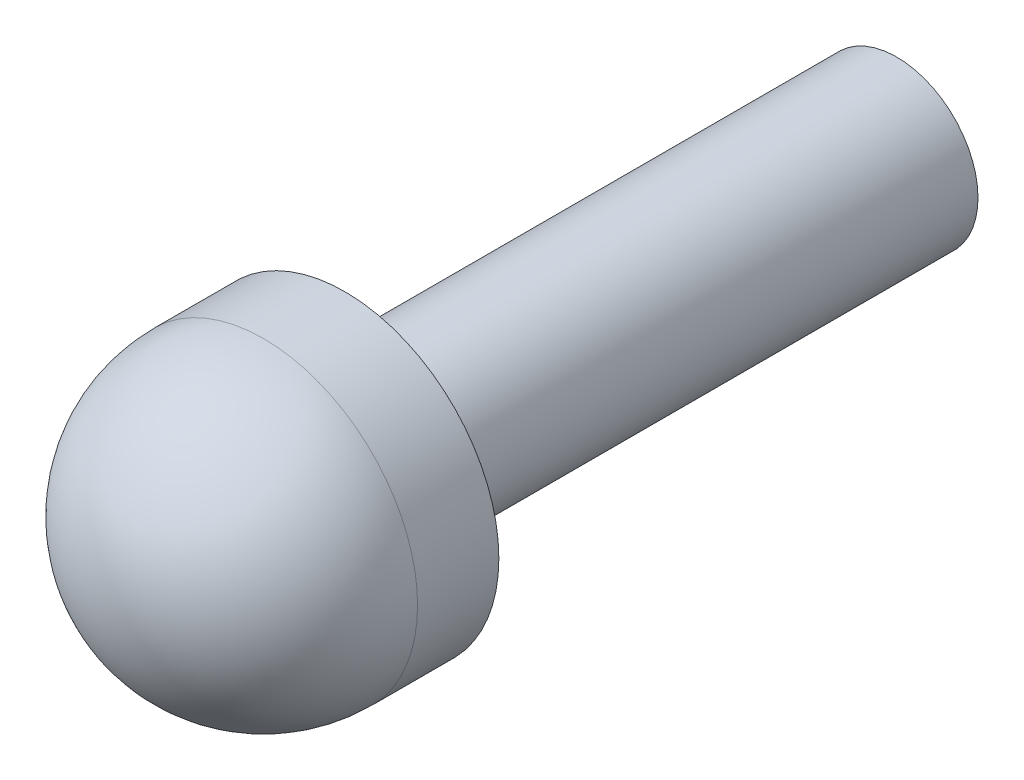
ISO-10303-21;
HEADER;
FILE_DESCRIPTION(('STEP AP214'),'2;1');
FILE_NAME('part.step','',(''),(''),'','','');
FILE_SCHEMA(('AUTOMOTIVE_DESIGN { 1 0 10303 214 1 1 1 1 }'));
ENDSEC;
DATA;
#1=APPLICATION_CONTEXT('core data for automotive mechanical design processes');
#2=APPLICATION_PROTOCOL_DEFINITION('international standard','automotive_design',2000,#1);
#3=PRODUCT_CONTEXT('',#1,'mechanical');
#4=PRODUCT('Part','Part','',(#3));
#5=PRODUCT_RELATED_PRODUCT_CATEGORY('part','',(#4));
#6=PRODUCT_DEFINITION_FORMATION('','',#4);
#7=PRODUCT_DEFINITION_CONTEXT('part definition',#1,'design');
#8=PRODUCT_DEFINITION('design','',#6,#7);
#9=PRODUCT_DEFINITION_SHAPE('','',#8);
#10=(LENGTH_UNIT() NAMED_UNIT(*) SI_UNIT(.MILLI.,.METRE.));
#11=(NAMED_UNIT(*) PLANE_ANGLE_UNIT() SI_UNIT($,.RADIAN.));
#12=(NAMED_UNIT(*) SI_UNIT($,.STERADIAN.) SOLID_ANGLE_UNIT());
#13=UNCERTAINTY_MEASURE_WITH_UNIT(LENGTH_MEASURE(1.E-05),#10,'distance_accuracy_value','');
#14=(GEOMETRIC_REPRESENTATION_CONTEXT(3) GLOBAL_UNCERTAINTY_ASSIGNED_CONTEXT((#13)) GLOBAL_UNIT_ASSIGNED_CONTEXT((#10,
#11,#12)) REPRESENTATION_CONTEXT('',''));
#15=CARTESIAN_POINT('',(0.,0.,0.));
#16=DIRECTION('',(0.,0.,1.));
#17=DIRECTION('',(1.,0.,0.));
#18=AXIS2_PLACEMENT_3D('',#15,#16,#17);
#19=CARTESIAN_POINT('',(0.,0.,-0.914399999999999));
#20=DIRECTION('',(0.,0.,1.));
#21=DIRECTION('',(0.,1.,0.));
#22=AXIS2_PLACEMENT_3D('',#19,#20,#21);
#23=SPHERICAL_SURFACE('',#22,0.914399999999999);
#24=CARTESIAN_POINT('',(0.,0.,-0.914399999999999));
#25=DIRECTION('',(0.,0.,1.));
#26=DIRECTION('',(1.,0.,0.));
#27=AXIS2_PLACEMENT_3D('',#24,#25,#26);
#28=CIRCLE('',#27,0.914399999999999);
#29=CARTESIAN_POINT('',(0.914399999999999,0.,-0.914399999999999));
#30=VERTEX_POINT('',#29);
#31=EDGE_CURVE('E10',#30,#30,#28,.T.);
#32=ORIENTED_EDGE('',*,*,#31,.T.);
#33=EDGE_LOOP('',(#32));
#34=FACE_BOUND('',#33,.T.);
#35=ADVANCED_FACE('F33',(#34),#23,.T.);
#36=CARTESIAN_POINT('',(0.,0.,0.));
#37=DIRECTION('',(0.,0.,1.));
#38=DIRECTION('',(1.,0.,0.));
#39=AXIS2_PLACEMENT_3D('',#36,#37,#38);
#40=CYLINDRICAL_SURFACE('',#39,0.9144);
#41=ORIENTED_EDGE('',*,*,#31,.F.);
#42=EDGE_LOOP('',(#41));
#43=FACE_BOUND('',#42,.T.);
#44=CARTESIAN_POINT('',(0.,0.,-1.397));
#45=DIRECTION('',(0.,0.,1.));
#46=DIRECTION('',(1.,0.,0.));
#47=AXIS2_PLACEMENT_3D('',#44,#45,#46);
#48=CIRCLE('',#47,0.9144);
#49=CARTESIAN_POINT('',(0.9144,0.,-1.397));
#50=VERTEX_POINT('',#49);
#51=EDGE_CURVE('E39',#50,#50,#48,.T.);
#52=ORIENTED_EDGE('',*,*,#51,.T.);
#53=EDGE_LOOP('',(#52));
#54=FACE_BOUND('',#53,.T.);
#55=ADVANCED_FACE('F65',(#43,#54),#40,.T.);
#56=CARTESIAN_POINT('',(0.,0.4826,-1.397));
#57=DIRECTION('',(0.,0.,1.));
#58=DIRECTION('',(1.,0.,0.));
#59=AXIS2_PLACEMENT_3D('',#56,#57,#58);
#60=PLANE('',#59);
#61=ORIENTED_EDGE('',*,*,#51,.F.);
#62=EDGE_LOOP('',(#61));
#63=FACE_BOUND('',#62,.T.);
#64=CARTESIAN_POINT('',(0.,0.,-1.397));
#65=DIRECTION('',(0.,0.,1.));
#66=DIRECTION('',(1.,0.,0.));
#67=AXIS2_PLACEMENT_3D('',#64,#65,#66);
#68=CIRCLE('',#67,0.4826);
#69=CARTESIAN_POINT('',(0.4826,0.,-1.397));
#70=VERTEX_POINT('',#69);
#71=EDGE_CURVE('E43',#70,#70,#68,.T.);
#72=ORIENTED_EDGE('',*,*,#71,.T.);
#73=EDGE_LOOP('',(#72));
#74=FACE_BOUND('',#73,.T.);
#75=ADVANCED_FACE('F61',(#63,#74),#60,.F.);
#76=CARTESIAN_POINT('',(0.,0.,0.));
#77=DIRECTION('',(0.,0.,1.));
#78=DIRECTION('',(1.,0.,0.));
#79=AXIS2_PLACEMENT_3D('',#76,#77,#78);
#80=CYLINDRICAL_SURFACE('',#79,0.482599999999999);
#81=ORIENTED_EDGE('',*,*,#71,.F.);
#82=EDGE_LOOP('',(#81));
#83=FACE_BOUND('',#82,.T.);
#84=CARTESIAN_POINT('',(0.,0.,-4.6736));
#85=DIRECTION('',(0.,0.,1.));
#86=DIRECTION('',(1.,0.,0.));
#87=AXIS2_PLACEMENT_3D('',#84,#85,#86);
#88=CIRCLE('',#87,0.482599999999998);
#89=CARTESIAN_POINT('',(0.482599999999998,0.,-4.6736));
#90=VERTEX_POINT('',#89);
#91=EDGE_CURVE('E47',#90,#90,#88,.T.);
#92=ORIENTED_EDGE('',*,*,#91,.T.);
#93=EDGE_LOOP('',(#92));
#94=FACE_BOUND('',#93,.T.);
#95=ADVANCED_FACE('F53',(#83,#94),#80,.T.);
#96=CARTESIAN_POINT('',(0.,0.,-4.6736));
#97=DIRECTION('',(0.,0.,1.));
#98=DIRECTION('',(1.,0.,0.));
#99=AXIS2_PLACEMENT_3D('',#96,#97,#98);
#100=PLANE('',#99);
#101=ORIENTED_EDGE('',*,*,#91,.F.);
#102=EDGE_LOOP('',(#101));
#103=FACE_BOUND('',#102,.T.);
#104=ADVANCED_FACE('F55',(#103),#100,.F.);
#105=CLOSED_SHELL('',(#35,#55,#75,#95,#104));
#106=MANIFOLD_SOLID_BREP('B2',#105);
#107=ADVANCED_BREP_SHAPE_REPRESENTATION('',(#18,#106),#14);
#108=SHAPE_DEFINITION_REPRESENTATION(#9,#107);
ENDSEC;
END-ISO-10303-21;
